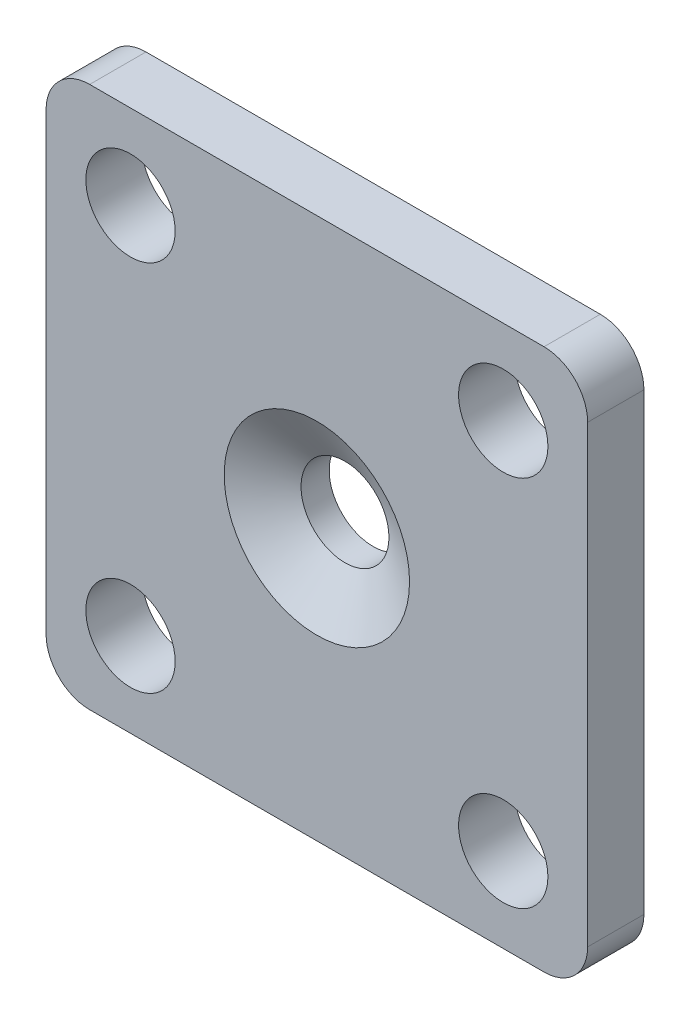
from build123d import *

# Parameters (mm, degrees)
SKETCH1_W           = 9.779
SKETCH1_H           = 9.779
SKETCH1_R           = 0.79375
SKETCH1_R_2         = 0.80645
BOSS_EXTRUDE1_DEPTH = 1.016
CHAMFER2_SIZE       = 0.508
CHAMFER2_SIZE2      = 0.87988181
SKETCH2_R           = 3.7846
SKETCH2_R_2         = 3.1496
SKETCH2_R_3         = 1.6002
SKETCH2_R_4         = 0.9398
CUT_EXTRUDE1_DEPTH  = 0.381
FILLET1_R           = 0.7874


with BuildPart() as part:
    # Sketch1 → Boss-Extrude1 (new body)
    with BuildSketch(Plane.XY):
        Rectangle(SKETCH1_W, SKETCH1_H)
        Circle(SKETCH1_R, mode=Mode.SUBTRACT)
        with Locations((-3.3655, 3.3655)):
            Circle(SKETCH1_R_2, mode=Mode.SUBTRACT)
        with Locations((3.3655, 3.3655)):
            Circle(SKETCH1_R_2, mode=Mode.SUBTRACT)
        with Locations((3.3655, -3.3655)):
            Circle(SKETCH1_R_2, mode=Mode.SUBTRACT)
        with Locations((-3.3655, -3.3655)):
            Circle(SKETCH1_R_2, mode=Mode.SUBTRACT)
    extrude(amount=BOSS_EXTRUDE1_DEPTH)

    # Chamfer2
    chamfer2_edges = [part.edges().sort_by_distance(p)[0] for p in [
        (-0.79375, 0, 1.016),
    ]]
    chamfer2_side = [part.faces().sort_by_distance(p)[0] for p in [
        (-0.79375, 0, 0.508),
    ]]
    chamfer(chamfer2_edges, length=CHAMFER2_SIZE, length2=CHAMFER2_SIZE2, reference=chamfer2_side[0])

    # Sketch2 → Cut-Extrude1 (cut)
    # profile 1 of 2: a face of its own
    with BuildSketch(Plane(origin=(0, 0, 0), x_dir=(-1, 0, 0), z_dir=(0, 0, -1))):
        Circle(SKETCH2_R)
        Circle(SKETCH2_R_2, mode=Mode.SUBTRACT)
    # profile 2 of 2: a face of its own
    with BuildSketch(Plane(origin=(0, 0, 0), x_dir=(-1, 0, 0), z_dir=(0, 0, -1))):
        Circle(SKETCH2_R_3)
        Circle(SKETCH2_R_4, mode=Mode.SUBTRACT)
    extrude(amount=-CUT_EXTRUDE1_DEPTH, mode=Mode.SUBTRACT)

    # Fillet1
    fillet1_edges = [part.edges().sort_by_distance(p)[0] for p in [
        (4.8895, -4.8895, 0.508),
        (-4.8895, -4.8895, 0.508),
        (-4.8895, 4.8895, 0.508),
        (4.8895, 4.8895, 0.508),
    ]]
    fillet(fillet1_edges, radius=FILLET1_R)


solid = part.part
